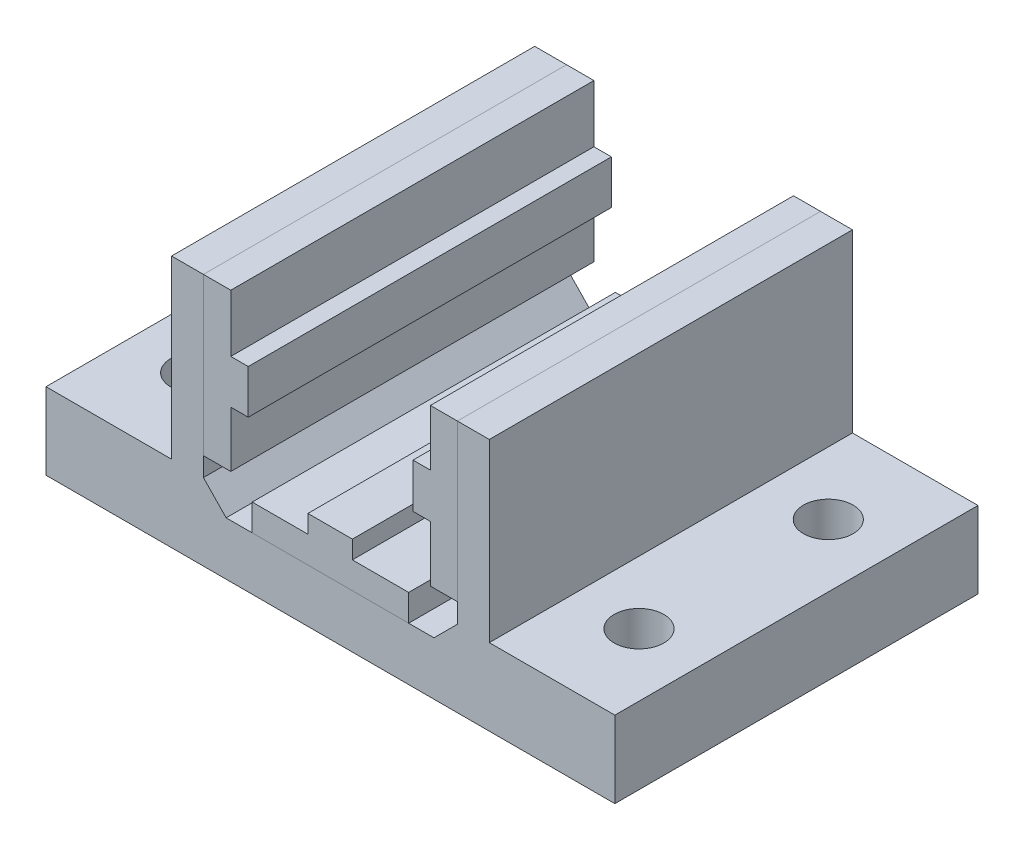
from build123d import *

# Parameters (mm, degrees)
BOSS_EXTRUDE1_DEPTH = 47.752
BOSS_EXTRUDE2_DEPTH = 47.752
BOSS_EXTRUDE3_DEPTH = 47.752
BOSS_EXTRUDE4_DEPTH = 47.752
SKETCH8_R           = 3.2639
CUT_EXTRUDE1_DEPTH  = 127


with BuildPart() as part:
    # Sketch1 → Boss-Extrude1 (new body)
    with BuildSketch(Plane.XY):
        Polygon((-22.201293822, -33.2232), (52.601706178, -33.2232), (52.601706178, -23.1394), (36.091706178, -23.1394), (36.091706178, 0), (31.900706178, 0), (31.900706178, -23.1394), (28.811789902, -26.228316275), (1.486022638, -26.228316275), (-1.500293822, -23.1394), (-1.500293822, 0), (-5.691293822, 0), (-5.691293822, -23.1394), (-22.201293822, -23.1394), align=None)
    extrude(amount=BOSS_EXTRUDE1_DEPTH)

    # Sketch8 → Cut-Extrude1 (cut)
    with BuildSketch(Plane(origin=(0, -23.1394, 0), x_dir=(-1, 0, 0), z_dir=(0, 1, 0))):
        with Locations((13.946293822, 11.43)):
            Circle(SKETCH8_R)
        with Locations((13.946293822, 36.322)):
            Circle(SKETCH8_R)
        with Locations((-44.346706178, 11.43)):
            Circle(SKETCH8_R)
        with Locations((-44.346706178, 36.322)):
            Circle(SKETCH8_R)
    extrude(amount=-CUT_EXTRUDE1_DEPTH, mode=Mode.SUBTRACT)


with BuildPart() as body_2:
    # Sketch2 → Boss-Extrude2 (new body)
    with BuildSketch(Plane(origin=(0, 0, 0), x_dir=(-1, 0, 0), z_dir=(0, 0, -1))):
        Polygon((-31.900706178, 0), (-28.344706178, 0), (-28.344706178, -7.366), (-26.058706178, -7.366), (-26.058706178, -13.208), (-28.344706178, -13.208), (-28.344706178, -20.574), (-31.900706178, -20.574), align=None)
    extrude(amount=-BOSS_EXTRUDE2_DEPTH)


with BuildPart() as body_3:
    # Sketch4 → Boss-Extrude3 (new body)
    with BuildSketch(Plane.XY.offset(47.752)):
        Polygon((-1.500293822, 0), (-1.500293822, -20.645913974), (2.097938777, -20.645913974), (2.097938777, -13.317527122), (4.392686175, -13.317527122), (4.392686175, -7.543646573), (2.097938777, -7.543646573), (2.097938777, 0), align=None)
    extrude(amount=-BOSS_EXTRUDE3_DEPTH)


with BuildPart() as body_4:
    # Sketch5 → Boss-Extrude4 (new body)
    with BuildSketch(Plane.XY.offset(47.752)):
        Polygon((4.915022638, -26.228316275), (25.489022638, -26.228316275), (25.489022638, -22.718589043), (18.087146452, -22.718589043), (18.087146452, -20.349817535), (12.239241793, -20.349817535), (12.239241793, -22.718589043), (4.915022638, -22.718589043), align=None)
    extrude(amount=-BOSS_EXTRUDE4_DEPTH)


solid = Compound([part.part, body_2.part, body_3.part, body_4.part])
